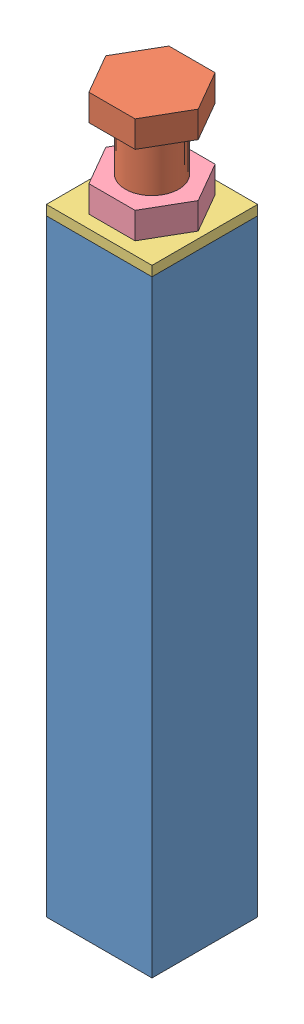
SolidWorks assembly Assem4.sldasm, configuration Default (file format 4400). Lengths in mm.
Overall size (50.8 347.66 50.8).
4 component instances, 4 part files, 9 mates.
Components (placement in the parent):
- short leg-1: short leg.SLDPRT [Default] at (-102.0664 -0.3101 54.0697) size (50.8 292.1 50.8)
- bolt-1: bolt.SLDPRT [Default] at (-102.0664 201.3024 79.4697) x (-1 0 0) z (0 -1 0) size (44.45 38.49 169.67)
- leg cap-1: leg cap.SLDPRT [Default] at (-102.0664 150.5024 79.4697) x (-1 0 0) z (0 0 1) size (50.8 4.76 50.8)
- nut-1: nut.SLDPRT [Default] at (-102.0664 150.5024 79.4697) x (-1 0 0) z (0 1 0) size (44.45 38.49 12.7)
Mates (geometry in assembly coordinates):
- Concentric1: concentric anti-aligned: cylinder of leg cap-1 through (-119.4165 150.5024 79.4697) axis (0 -1 0) radius 12.7; cylinder of nut-1 through (-119.4165 150.5024 79.4697) axis (0 1 0) radius 12.8107
- Concentric2: concentric anti-aligned: cylinder of bolt-1 through (-119.4165 31.6304 79.4697) axis (0 1 0) radius 12.7; cylinder of leg cap-1 through (-119.4165 150.5024 79.4697) axis (0 -1 0) radius 12.7
- Coincident1: coincident anti-aligned: plane of leg cap-1 through (-144.8165 150.5024 104.8697) normal (0 1 0); plane of nut-1 through (-130.529 150.5024 60.2223) normal (0 -1 0)
- Parallel1: parallel aligned: plane of leg cap-1 through (-94.0165 150.5024 104.8697) normal (0 0 1); plane of nut-1 through (-130.529 150.5024 98.7171) normal (0 0 1)
- Distance1: distance = 25.4 mm anti-aligned: plane of nut-1 through (-113.1789 163.2024 60.2223) normal (0 1 0); plane of bolt-1 through (-113.1789 188.6024 98.7171) normal (0 -1 0)
- Parallel2: parallel aligned: plane of bolt-1 through (-108.304 201.3024 98.7171) normal (0 0 1); plane of nut-1 through (-130.529 150.5024 98.7171) normal (0 0 1)
- Coincident5: coincident anti-aligned: plane of short leg-1 through (-76.6664 145.7399 54.0697) normal (0 1 0); plane of leg cap-1 through (-144.8165 145.7399 104.8697) normal (0 -1 0)
- Coincident6: coincident aligned: plane of short leg-1 through (-127.4664 -146.3601 104.8697) normal (0 0 1); plane of leg cap-1 through (-94.0165 150.5024 104.8697) normal (0 0 1)
- Coincident8: coincident aligned: plane of short leg-1 through (-76.6664 -146.3601 104.8697) normal (1 0 0); plane of leg cap-1 through (-76.6664 150.5024 54.0697) normal (1 0 0)
